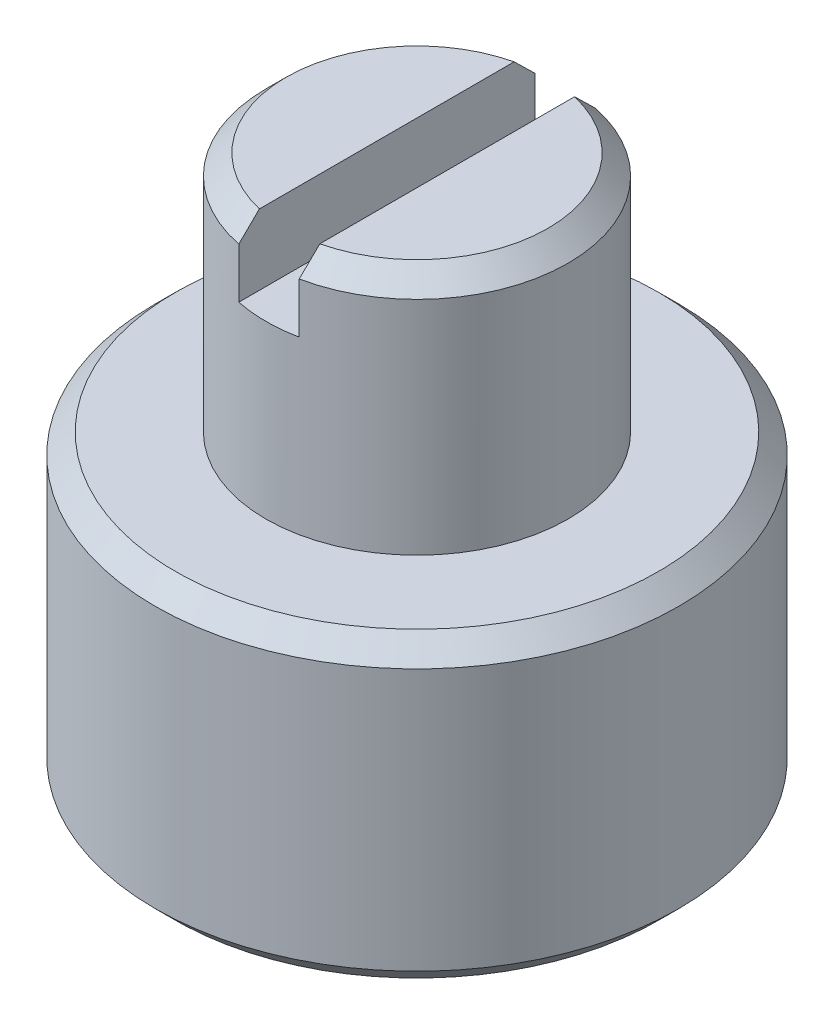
ISO-10303-21;
HEADER;
FILE_DESCRIPTION(('STEP AP214'),'2;1');
FILE_NAME('part.step','',(''),(''),'','','');
FILE_SCHEMA(('AUTOMOTIVE_DESIGN { 1 0 10303 214 1 1 1 1 }'));
ENDSEC;
DATA;
#1=APPLICATION_CONTEXT('core data for automotive mechanical design processes');
#2=APPLICATION_PROTOCOL_DEFINITION('international standard','automotive_design',2000,#1);
#3=PRODUCT_CONTEXT('',#1,'mechanical');
#4=PRODUCT('Part','Part','',(#3));
#5=PRODUCT_RELATED_PRODUCT_CATEGORY('part','',(#4));
#6=PRODUCT_DEFINITION_FORMATION('','',#4);
#7=PRODUCT_DEFINITION_CONTEXT('part definition',#1,'design');
#8=PRODUCT_DEFINITION('design','',#6,#7);
#9=PRODUCT_DEFINITION_SHAPE('','',#8);
#10=(LENGTH_UNIT() NAMED_UNIT(*) SI_UNIT(.MILLI.,.METRE.));
#11=(NAMED_UNIT(*) PLANE_ANGLE_UNIT() SI_UNIT($,.RADIAN.));
#12=(NAMED_UNIT(*) SI_UNIT($,.STERADIAN.) SOLID_ANGLE_UNIT());
#13=UNCERTAINTY_MEASURE_WITH_UNIT(LENGTH_MEASURE(1.E-05),#10,'distance_accuracy_value','');
#14=(GEOMETRIC_REPRESENTATION_CONTEXT(3) GLOBAL_UNCERTAINTY_ASSIGNED_CONTEXT((#13)) GLOBAL_UNIT_ASSIGNED_CONTEXT((#10,
#11,#12)) REPRESENTATION_CONTEXT('',''));
#15=CARTESIAN_POINT('',(0.,0.,0.));
#16=DIRECTION('',(0.,0.,1.));
#17=DIRECTION('',(1.,0.,0.));
#18=AXIS2_PLACEMENT_3D('',#15,#16,#17);
#19=CARTESIAN_POINT('',(56.,0.,1.65));
#20=DIRECTION('',(0.,1.,0.));
#21=DIRECTION('',(0.,0.,1.));
#22=AXIS2_PLACEMENT_3D('',#19,#20,#21);
#23=PLANE('',#22);
#24=DIRECTION('',(0.,0.,1.));
#25=VECTOR('',#24,1.);
#26=CARTESIAN_POINT('',(55.7,0.,-0.949999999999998));
#27=LINE('',#26,#25);
#28=CARTESIAN_POINT('',(55.7,0.,0.385088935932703));
#29=VERTEX_POINT('',#28);
#30=CARTESIAN_POINT('',(55.7,0.,2.9149110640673));
#31=VERTEX_POINT('',#30);
#32=EDGE_CURVE('E236',#29,#31,#27,.T.);
#33=ORIENTED_EDGE('',*,*,#32,.F.);
#34=CARTESIAN_POINT('',(56.,0.,1.65));
#35=DIRECTION('',(0.,1.,0.));
#36=DIRECTION('',(0.,0.,1.));
#37=AXIS2_PLACEMENT_3D('',#34,#35,#36);
#38=CIRCLE('',#37,1.29999999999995);
#39=EDGE_CURVE('E238',#29,#31,#38,.T.);
#40=ORIENTED_EDGE('',*,*,#39,.T.);
#41=EDGE_LOOP('',(#33,#40));
#42=FACE_BOUND('',#41,.T.);
#43=ADVANCED_FACE('F67',(#42),#23,.T.);
#44=DIRECTION('',(0.,0.,1.));
#45=VECTOR('',#44,1.);
#46=CARTESIAN_POINT('',(56.3,0.,-0.949999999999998));
#47=LINE('',#46,#45);
#48=CARTESIAN_POINT('',(56.3,0.,0.385088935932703));
#49=VERTEX_POINT('',#48);
#50=CARTESIAN_POINT('',(56.3,0.,2.9149110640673));
#51=VERTEX_POINT('',#50);
#52=EDGE_CURVE('E136',#49,#51,#47,.T.);
#53=ORIENTED_EDGE('',*,*,#52,.T.);
#54=CARTESIAN_POINT('',(56.,0.,1.65));
#55=DIRECTION('',(0.,1.,0.));
#56=DIRECTION('',(0.,0.,1.));
#57=AXIS2_PLACEMENT_3D('',#54,#55,#56);
#58=CIRCLE('',#57,1.29999999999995);
#59=EDGE_CURVE('E14',#51,#49,#58,.T.);
#60=ORIENTED_EDGE('',*,*,#59,.T.);
#61=EDGE_LOOP('',(#53,#60));
#62=FACE_BOUND('',#61,.T.);
#63=ADVANCED_FACE('F214',(#62),#23,.T.);
#64=CARTESIAN_POINT('',(58.6,-5.4,1.65));
#65=DIRECTION('',(0.,-1.,0.));
#66=DIRECTION('',(0.,0.,-1.));
#67=AXIS2_PLACEMENT_3D('',#64,#65,#66);
#68=PLANE('',#67);
#69=CARTESIAN_POINT('',(56.,-5.4,1.65));
#70=DIRECTION('',(0.,-1.,0.));
#71=DIRECTION('',(0.,0.,-1.));
#72=AXIS2_PLACEMENT_3D('',#69,#70,#71);
#73=CIRCLE('',#72,2.40000000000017);
#74=CARTESIAN_POINT('',(56.,-5.4,-0.750000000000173));
#75=VERTEX_POINT('',#74);
#76=EDGE_CURVE('E145',#75,#75,#73,.T.);
#77=ORIENTED_EDGE('',*,*,#76,.T.);
#78=EDGE_LOOP('',(#77));
#79=FACE_BOUND('',#78,.T.);
#80=CARTESIAN_POINT('',(56.,-5.4,1.65));
#81=DIRECTION('',(0.,-1.,0.));
#82=DIRECTION('',(0.,0.,-1.));
#83=AXIS2_PLACEMENT_3D('',#80,#81,#82);
#84=CIRCLE('',#83,1.3);
#85=CARTESIAN_POINT('',(56.,-5.4,0.349999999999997));
#86=VERTEX_POINT('',#85);
#87=EDGE_CURVE('E240',#86,#86,#84,.T.);
#88=ORIENTED_EDGE('',*,*,#87,.F.);
#89=EDGE_LOOP('',(#88));
#90=FACE_BOUND('',#89,.T.);
#91=ADVANCED_FACE('F210',(#79,#90),#68,.T.);
#92=CARTESIAN_POINT('',(56.,-1065.45754338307,1.65));
#93=DIRECTION('',(0.,-1.,0.));
#94=DIRECTION('',(0.,0.,-1.));
#95=AXIS2_PLACEMENT_3D('',#92,#93,#94);
#96=CYLINDRICAL_SURFACE('',#95,2.6);
#97=CARTESIAN_POINT('',(56.,-5.20000000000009,1.65));
#98=DIRECTION('',(0.,-1.,0.));
#99=DIRECTION('',(0.,0.,-1.));
#100=AXIS2_PLACEMENT_3D('',#97,#98,#99);
#101=CIRCLE('',#100,2.6);
#102=CARTESIAN_POINT('',(56.,-5.20000000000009,-0.949999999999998));
#103=VERTEX_POINT('',#102);
#104=EDGE_CURVE('E155',#103,#103,#101,.F.);
#105=CARTESIAN_POINT('',(56.,-2.59999999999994,1.65));
#106=DIRECTION('',(0.,1.,0.));
#107=DIRECTION('',(0.,0.,1.));
#108=AXIS2_PLACEMENT_3D('',#105,#106,#107);
#109=CIRCLE('',#108,2.6);
#110=CARTESIAN_POINT('',(56.,-2.59999999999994,-0.949999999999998));
#111=VERTEX_POINT('',#110);
#112=EDGE_CURVE('E152',#111,#111,#109,.F.);
#113=CARTESIAN_POINT('',(56.,-5.20000000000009,-0.949999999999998));
#114=CARTESIAN_POINT('',(56.,-5.17291666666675,-0.949999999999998));
#115=CARTESIAN_POINT('',(56.,-5.1458333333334,-0.949999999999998));
#116=CARTESIAN_POINT('',(56.,-5.09166666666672,-0.949999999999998));
#117=CARTESIAN_POINT('',(56.,-5.06458333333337,-0.949999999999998));
#118=CARTESIAN_POINT('',(56.,-5.01041666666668,-0.949999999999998));
#119=CARTESIAN_POINT('',(56.,-4.98333333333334,-0.949999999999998));
#120=CARTESIAN_POINT('',(56.,-4.92916666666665,-0.949999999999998));
#121=CARTESIAN_POINT('',(56.,-4.90208333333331,-0.949999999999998));
#122=CARTESIAN_POINT('',(56.,-4.84791666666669,-0.949999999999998));
#123=CARTESIAN_POINT('',(56.,-4.82083333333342,-0.949999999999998));
#124=CARTESIAN_POINT('',(56.,-4.76666666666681,-0.949999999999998));
#125=CARTESIAN_POINT('',(56.,-4.73958333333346,-0.949999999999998));
#126=CARTESIAN_POINT('',(56.,-4.68541666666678,-0.949999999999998));
#127=CARTESIAN_POINT('',(56.,-4.65833333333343,-0.949999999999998));
#128=CARTESIAN_POINT('',(56.,-4.60416666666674,-0.949999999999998));
#129=CARTESIAN_POINT('',(56.,-4.5770833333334,-0.949999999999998));
#130=CARTESIAN_POINT('',(56.,-4.52291666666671,-0.949999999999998));
#131=CARTESIAN_POINT('',(56.,-4.49583333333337,-0.949999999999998));
#132=CARTESIAN_POINT('',(56.,-4.44166666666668,-0.949999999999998));
#133=CARTESIAN_POINT('',(56.,-4.41458333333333,-0.949999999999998));
#134=CARTESIAN_POINT('',(56.,-4.36041666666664,-0.949999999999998));
#135=CARTESIAN_POINT('',(56.,-4.3333333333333,-0.949999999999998));
#136=CARTESIAN_POINT('',(56.,-4.27916666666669,-0.949999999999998));
#137=CARTESIAN_POINT('',(56.,-4.25208333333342,-0.949999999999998));
#138=CARTESIAN_POINT('',(56.,-4.1979166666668,-0.949999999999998));
#139=CARTESIAN_POINT('',(56.,-4.17083333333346,-0.949999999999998));
#140=CARTESIAN_POINT('',(56.,-4.11666666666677,-0.949999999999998));
#141=CARTESIAN_POINT('',(56.,-4.08958333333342,-0.949999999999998));
#142=CARTESIAN_POINT('',(56.,-4.03541666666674,-0.949999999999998));
#143=CARTESIAN_POINT('',(56.,-4.00833333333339,-0.949999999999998));
#144=CARTESIAN_POINT('',(56.,-3.9541666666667,-0.949999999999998));
#145=CARTESIAN_POINT('',(56.,-3.92708333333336,-0.949999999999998));
#146=CARTESIAN_POINT('',(56.,-3.87291666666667,-0.949999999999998));
#147=CARTESIAN_POINT('',(56.,-3.84583333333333,-0.949999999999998));
#148=CARTESIAN_POINT('',(56.,-3.79166666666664,-0.949999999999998));
#149=CARTESIAN_POINT('',(56.,-3.76458333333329,-0.949999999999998));
#150=CARTESIAN_POINT('',(56.,-3.7104166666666,-0.949999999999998));
#151=CARTESIAN_POINT('',(56.,-3.68333333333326,-0.949999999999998));
#152=CARTESIAN_POINT('',(56.,-3.62916666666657,-0.949999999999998));
#153=CARTESIAN_POINT('',(56.,-3.60208333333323,-0.949999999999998));
#154=CARTESIAN_POINT('',(56.,-3.54791666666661,-0.949999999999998));
#155=CARTESIAN_POINT('',(56.,-3.52083333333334,-0.949999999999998));
#156=CARTESIAN_POINT('',(56.,-3.46666666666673,-0.949999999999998));
#157=CARTESIAN_POINT('',(56.,-3.43958333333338,-0.949999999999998));
#158=CARTESIAN_POINT('',(56.,-3.3854166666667,-0.949999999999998));
#159=CARTESIAN_POINT('',(56.,-3.35833333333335,-0.949999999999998));
#160=CARTESIAN_POINT('',(56.,-3.30416666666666,-0.949999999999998));
#161=CARTESIAN_POINT('',(56.,-3.27708333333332,-0.949999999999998));
#162=CARTESIAN_POINT('',(56.,-3.22291666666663,-0.949999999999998));
#163=CARTESIAN_POINT('',(56.,-3.19583333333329,-0.949999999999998));
#164=CARTESIAN_POINT('',(56.,-3.1416666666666,-0.949999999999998));
#165=CARTESIAN_POINT('',(56.,-3.11458333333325,-0.949999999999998));
#166=CARTESIAN_POINT('',(56.,-3.06041666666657,-0.949999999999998));
#167=CARTESIAN_POINT('',(56.,-3.03333333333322,-0.949999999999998));
#168=CARTESIAN_POINT('',(56.,-2.97916666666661,-0.949999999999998));
#169=CARTESIAN_POINT('',(56.,-2.95208333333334,-0.949999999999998));
#170=CARTESIAN_POINT('',(56.,-2.89791666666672,-0.949999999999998));
#171=CARTESIAN_POINT('',(56.,-2.87083333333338,-0.949999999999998));
#172=CARTESIAN_POINT('',(56.,-2.81666666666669,-0.949999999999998));
#173=CARTESIAN_POINT('',(56.,-2.78958333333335,-0.949999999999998));
#174=CARTESIAN_POINT('',(56.,-2.73541666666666,-0.949999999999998));
#175=CARTESIAN_POINT('',(56.,-2.70833333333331,-0.949999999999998));
#176=CARTESIAN_POINT('',(56.,-2.65416666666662,-0.949999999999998));
#177=CARTESIAN_POINT('',(56.,-2.62708333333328,-0.949999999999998));
#178=CARTESIAN_POINT('',(56.,-2.59999999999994,-0.949999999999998));
#179=B_SPLINE_CURVE_WITH_KNOTS('',3,(#113,#114,#115,#116,#117,#118,#119,#120,#121,#122,#123,
#124,#125,#126,#127,#128,#129,#130,#131,#132,#133,#134,#135,#136,#137,#138,#139,#140,#141,#142,
#143,#144,#145,#146,#147,#148,#149,#150,#151,#152,#153,#154,#155,#156,#157,#158,#159,#160,#161,
#162,#163,#164,#165,#166,#167,#168,#169,#170,#171,#172,#173,#174,#175,#176,#177,#178),
.UNSPECIFIED.,.F.,.F.,(4,2,2,2,2,2,2,2,2,2,2,2,2,2,2,2,2,2,2,2,2,2,2,2,2,2,2,2,2,2,2,2,4),(0.,
0.0812500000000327,0.162500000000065,0.243750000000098,0.325000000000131,0.406249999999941,
0.487499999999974,0.568750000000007,0.650000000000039,0.731250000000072,0.812500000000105,
0.893750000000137,0.974999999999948,1.05624999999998,1.13750000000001,1.21875000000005,
1.30000000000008,1.38125000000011,1.46250000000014,1.54375000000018,1.62500000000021,
1.70625000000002,1.78750000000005,1.86875000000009,1.95000000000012,2.03125000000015,
2.11250000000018,2.19375000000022,2.27500000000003,2.35625000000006,2.43750000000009,
2.51875000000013,2.60000000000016),.UNSPECIFIED.);
#180=EDGE_CURVE('BSEAM206',#103,#111,#179,.T.);
#181=ORIENTED_EDGE('',*,*,#104,.T.);
#182=ORIENTED_EDGE('',*,*,#112,.T.);
#183=ORIENTED_EDGE('',*,*,#180,.T.);
#184=ORIENTED_EDGE('',*,*,#180,.F.);
#185=EDGE_LOOP('',(#181,#183,#182,#184));
#186=FACE_BOUND('',#185,.T.);
#187=ADVANCED_FACE('F206',(#186),#96,.T.);
#188=CARTESIAN_POINT('',(58.6,-2.4,1.65));
#189=DIRECTION('',(0.,1.,0.));
#190=DIRECTION('',(0.,0.,1.));
#191=AXIS2_PLACEMENT_3D('',#188,#189,#190);
#192=PLANE('',#191);
#193=CARTESIAN_POINT('',(56.,-2.4,1.65));
#194=DIRECTION('',(0.,1.,0.));
#195=DIRECTION('',(0.,0.,1.));
#196=AXIS2_PLACEMENT_3D('',#193,#194,#195);
#197=CIRCLE('',#196,2.40000000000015);
#198=CARTESIAN_POINT('',(56.,-2.4,-0.750000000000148));
#199=VERTEX_POINT('',#198);
#200=EDGE_CURVE('E158',#199,#199,#197,.T.);
#201=ORIENTED_EDGE('',*,*,#200,.T.);
#202=EDGE_LOOP('',(#201));
#203=FACE_BOUND('',#202,.T.);
#204=CARTESIAN_POINT('',(56.,-2.39999999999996,1.65));
#205=DIRECTION('',(0.,-1.,0.));
#206=DIRECTION('',(0.,0.,-1.));
#207=AXIS2_PLACEMENT_3D('',#204,#205,#206);
#208=CIRCLE('',#207,1.5);
#209=CARTESIAN_POINT('',(56.,-2.39999999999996,0.149999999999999));
#210=VERTEX_POINT('',#209);
#211=EDGE_CURVE('E374',#210,#210,#208,.T.);
#212=ORIENTED_EDGE('',*,*,#211,.T.);
#213=EDGE_LOOP('',(#212));
#214=FACE_BOUND('',#213,.T.);
#215=ADVANCED_FACE('F203',(#203,#214),#192,.T.);
#216=CARTESIAN_POINT('',(56.,-1065.45754338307,1.65));
#217=DIRECTION('',(0.,-1.,0.));
#218=DIRECTION('',(0.,0.,-1.));
#219=AXIS2_PLACEMENT_3D('',#216,#217,#218);
#220=CYLINDRICAL_SURFACE('',#219,1.5);
#221=DIRECTION('',(0.,-1.,0.));
#222=VECTOR('',#221,1.);
#223=CARTESIAN_POINT('',(55.7,-1065.45754338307,3.11969384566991));
#224=LINE('',#223,#222);
#225=CARTESIAN_POINT('',(55.7,-0.199999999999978,3.11969384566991));
#226=VERTEX_POINT('',#225);
#227=CARTESIAN_POINT('',(55.7,-0.699999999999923,3.11969384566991));
#228=VERTEX_POINT('',#227);
#229=EDGE_CURVE('E143',#226,#228,#224,.T.);
#230=ORIENTED_EDGE('',*,*,#229,.F.);
#231=CARTESIAN_POINT('',(56.,-0.199999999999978,1.65));
#232=DIRECTION('',(0.,1.,0.));
#233=DIRECTION('',(0.,0.,1.));
#234=AXIS2_PLACEMENT_3D('',#231,#232,#233);
#235=CIRCLE('',#234,1.5);
#236=CARTESIAN_POINT('',(55.7,-0.199999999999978,0.180306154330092));
#237=VERTEX_POINT('',#236);
#238=EDGE_CURVE('E162',#226,#237,#235,.F.);
#239=ORIENTED_EDGE('',*,*,#238,.T.);
#240=DIRECTION('',(0.,-1.,0.));
#241=VECTOR('',#240,1.);
#242=CARTESIAN_POINT('',(55.7,-1065.45754338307,0.180306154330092));
#243=LINE('',#242,#241);
#244=CARTESIAN_POINT('',(55.7,-0.699999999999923,0.180306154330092));
#245=VERTEX_POINT('',#244);
#246=EDGE_CURVE('E130',#245,#237,#243,.F.);
#247=ORIENTED_EDGE('',*,*,#246,.F.);
#248=CARTESIAN_POINT('',(56.,-0.699999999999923,1.65));
#249=DIRECTION('',(0.,-1.,0.));
#250=DIRECTION('',(0.,0.,-1.));
#251=AXIS2_PLACEMENT_3D('',#248,#249,#250);
#252=CIRCLE('',#251,1.5);
#253=CARTESIAN_POINT('',(56.3,-0.699999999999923,0.180306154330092));
#254=VERTEX_POINT('',#253);
#255=EDGE_CURVE('E132',#254,#245,#252,.F.);
#256=ORIENTED_EDGE('',*,*,#255,.F.);
#257=DIRECTION('',(0.,-1.,0.));
#258=VECTOR('',#257,1.);
#259=CARTESIAN_POINT('',(56.3,-1065.45754338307,0.180306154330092));
#260=LINE('',#259,#258);
#261=CARTESIAN_POINT('',(56.3,-0.199999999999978,0.180306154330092));
#262=VERTEX_POINT('',#261);
#263=EDGE_CURVE('E135',#262,#254,#260,.T.);
#264=ORIENTED_EDGE('',*,*,#263,.F.);
#265=CARTESIAN_POINT('',(56.,-0.199999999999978,1.65));
#266=DIRECTION('',(0.,1.,0.));
#267=DIRECTION('',(0.,0.,1.));
#268=AXIS2_PLACEMENT_3D('',#265,#266,#267);
#269=CIRCLE('',#268,1.5);
#270=CARTESIAN_POINT('',(56.3,-0.199999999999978,3.11969384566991));
#271=VERTEX_POINT('',#270);
#272=EDGE_CURVE('E142',#262,#271,#269,.F.);
#273=ORIENTED_EDGE('',*,*,#272,.T.);
#274=DIRECTION('',(0.,-1.,0.));
#275=VECTOR('',#274,1.);
#276=CARTESIAN_POINT('',(56.3,-1065.45754338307,3.11969384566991));
#277=LINE('',#276,#275);
#278=CARTESIAN_POINT('',(56.3,-0.699999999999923,3.11969384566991));
#279=VERTEX_POINT('',#278);
#280=EDGE_CURVE('E129',#279,#271,#277,.F.);
#281=ORIENTED_EDGE('',*,*,#280,.F.);
#282=EDGE_CURVE('E119',#228,#279,#252,.F.);
#283=ORIENTED_EDGE('',*,*,#282,.F.);
#284=EDGE_LOOP('',(#230,#239,#247,#256,#264,#273,#281,#283));
#285=FACE_BOUND('',#284,.T.);
#286=ORIENTED_EDGE('',*,*,#211,.F.);
#287=EDGE_LOOP('',(#286));
#288=FACE_BOUND('',#287,.T.);
#289=ADVANCED_FACE('F139',(#285,#288),#220,.T.);
#290=CARTESIAN_POINT('',(56.,-2.5,1.65));
#291=DIRECTION('',(0.,1.,0.));
#292=DIRECTION('',(0.,0.,1.));
#293=AXIS2_PLACEMENT_3D('',#290,#291,#292);
#294=PLANE('',#293);
#295=CARTESIAN_POINT('',(56.,-2.5,1.65));
#296=DIRECTION('',(0.,-1.,0.));
#297=DIRECTION('',(0.,0.,-1.));
#298=AXIS2_PLACEMENT_3D('',#295,#296,#297);
#299=CIRCLE('',#298,1.025);
#300=CARTESIAN_POINT('',(56.,-2.5,0.625000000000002));
#301=VERTEX_POINT('',#300);
#302=EDGE_CURVE('E378',#301,#301,#299,.T.);
#303=ORIENTED_EDGE('',*,*,#302,.T.);
#304=EDGE_LOOP('',(#303));
#305=FACE_BOUND('',#304,.T.);
#306=ADVANCED_FACE('F196',(#305),#294,.F.);
#307=CARTESIAN_POINT('',(56.,-5.4,1.65));
#308=DIRECTION('',(0.,-1.,0.));
#309=DIRECTION('',(0.,0.,-1.));
#310=AXIS2_PLACEMENT_3D('',#307,#308,#309);
#311=CYLINDRICAL_SURFACE('',#310,1.025);
#312=ORIENTED_EDGE('',*,*,#302,.F.);
#313=EDGE_LOOP('',(#312));
#314=FACE_BOUND('',#313,.T.);
#315=CARTESIAN_POINT('',(56.,-5.125,1.65));
#316=DIRECTION('',(0.,-1.,0.));
#317=DIRECTION('',(0.,0.,-1.));
#318=AXIS2_PLACEMENT_3D('',#315,#316,#317);
#319=CIRCLE('',#318,1.025);
#320=CARTESIAN_POINT('',(56.,-5.125,0.625000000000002));
#321=VERTEX_POINT('',#320);
#322=EDGE_CURVE('E381',#321,#321,#319,.T.);
#323=ORIENTED_EDGE('',*,*,#322,.T.);
#324=EDGE_LOOP('',(#323));
#325=FACE_BOUND('',#324,.T.);
#326=ADVANCED_FACE('F192',(#314,#325),#311,.F.);
#327=CARTESIAN_POINT('',(56.,-5.4,1.65));
#328=DIRECTION('',(0.,-1.,0.));
#329=DIRECTION('',(0.,0.,-1.));
#330=AXIS2_PLACEMENT_3D('',#327,#328,#329);
#331=CONICAL_SURFACE('',#330,1.3,0.785398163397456);
#332=ORIENTED_EDGE('',*,*,#322,.F.);
#333=EDGE_LOOP('',(#332));
#334=FACE_BOUND('',#333,.T.);
#335=ORIENTED_EDGE('',*,*,#87,.T.);
#336=EDGE_LOOP('',(#335));
#337=FACE_BOUND('',#336,.T.);
#338=ADVANCED_FACE('F186',(#334,#337),#331,.F.);
#339=CARTESIAN_POINT('',(55.7,0.,-0.949999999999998));
#340=DIRECTION('',(-1.,0.,0.));
#341=DIRECTION('',(0.,0.,1.));
#342=AXIS2_PLACEMENT_3D('',#339,#340,#341);
#343=PLANE('',#342);
#344=ORIENTED_EDGE('',*,*,#246,.T.);
#345=CARTESIAN_POINT('',(55.7,-0.199999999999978,0.180306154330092));
#346=CARTESIAN_POINT('',(55.7,-0.166607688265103,0.214379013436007));
#347=CARTESIAN_POINT('',(55.7,-0.133244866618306,0.248480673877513));
#348=CARTESIAN_POINT('',(55.7,-0.0665781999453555,0.316741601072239));
#349=CARTESIAN_POINT('',(55.7,-0.0332743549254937,0.350900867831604));
#350=CARTESIAN_POINT('',(55.7,0.,0.385088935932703));
#351=B_SPLINE_CURVE_WITH_KNOTS('',3,(#345,#346,#347,#348,#349,#350),.UNSPECIFIED.,.F.,.F.,(4,2,
4),(0.,0.143122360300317,0.286244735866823),.UNSPECIFIED.);
#352=EDGE_CURVE('E172',#237,#29,#351,.T.);
#353=ORIENTED_EDGE('',*,*,#352,.T.);
#354=ORIENTED_EDGE('',*,*,#32,.T.);
#355=CARTESIAN_POINT('',(55.7,0.,2.9149110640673));
#356=CARTESIAN_POINT('',(55.7,-0.0332743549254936,2.9490991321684));
#357=CARTESIAN_POINT('',(55.7,-0.0665781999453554,2.98325839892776));
#358=CARTESIAN_POINT('',(55.7,-0.133244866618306,3.05151932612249));
#359=CARTESIAN_POINT('',(55.7,-0.166607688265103,3.08562098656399));
#360=CARTESIAN_POINT('',(55.7,-0.199999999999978,3.11969384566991));
#361=B_SPLINE_CURVE_WITH_KNOTS('',3,(#355,#356,#357,#358,#359,#360),.UNSPECIFIED.,.F.,.F.,(4,2,
4),(0.,0.143122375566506,0.286244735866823),.UNSPECIFIED.);
#362=EDGE_CURVE('E165',#31,#226,#361,.T.);
#363=ORIENTED_EDGE('',*,*,#362,.T.);
#364=ORIENTED_EDGE('',*,*,#229,.T.);
#365=DIRECTION('',(0.,0.,1.));
#366=VECTOR('',#365,1.);
#367=CARTESIAN_POINT('',(55.7,-0.7,-0.949999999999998));
#368=LINE('',#367,#366);
#369=EDGE_CURVE('E125',#245,#228,#368,.T.);
#370=ORIENTED_EDGE('',*,*,#369,.F.);
#371=EDGE_LOOP('',(#344,#353,#354,#363,#364,#370));
#372=FACE_BOUND('',#371,.T.);
#373=ADVANCED_FACE('F181',(#372),#343,.F.);
#374=CARTESIAN_POINT('',(56.3,0.,-0.949999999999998));
#375=DIRECTION('',(1.,0.,0.));
#376=DIRECTION('',(0.,0.,-1.));
#377=AXIS2_PLACEMENT_3D('',#374,#375,#376);
#378=PLANE('',#377);
#379=ORIENTED_EDGE('',*,*,#280,.T.);
#380=CARTESIAN_POINT('',(56.3,-0.199999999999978,3.11969384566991));
#381=CARTESIAN_POINT('',(56.3,-0.166607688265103,3.08562098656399));
#382=CARTESIAN_POINT('',(56.3,-0.133244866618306,3.05151932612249));
#383=CARTESIAN_POINT('',(56.3,-0.0665781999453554,2.98325839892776));
#384=CARTESIAN_POINT('',(56.3,-0.0332743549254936,2.9490991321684));
#385=CARTESIAN_POINT('',(56.3,0.,2.9149110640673));
#386=B_SPLINE_CURVE_WITH_KNOTS('',3,(#380,#381,#382,#383,#384,#385),.UNSPECIFIED.,.F.,.F.,(4,2,
4),(0.,0.143122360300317,0.286244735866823),.UNSPECIFIED.);
#387=EDGE_CURVE('E76',#271,#51,#386,.T.);
#388=ORIENTED_EDGE('',*,*,#387,.T.);
#389=ORIENTED_EDGE('',*,*,#52,.F.);
#390=CARTESIAN_POINT('',(56.3,0.,0.385088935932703));
#391=CARTESIAN_POINT('',(56.3,-0.0332743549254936,0.350900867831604));
#392=CARTESIAN_POINT('',(56.3,-0.0665781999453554,0.316741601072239));
#393=CARTESIAN_POINT('',(56.3,-0.133244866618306,0.248480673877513));
#394=CARTESIAN_POINT('',(56.3,-0.166607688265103,0.214379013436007));
#395=CARTESIAN_POINT('',(56.3,-0.199999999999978,0.180306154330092));
#396=B_SPLINE_CURVE_WITH_KNOTS('',3,(#390,#391,#392,#393,#394,#395),.UNSPECIFIED.,.F.,.F.,(4,2,
4),(0.,0.143122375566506,0.286244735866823),.UNSPECIFIED.);
#397=EDGE_CURVE('E243',#49,#262,#396,.T.);
#398=ORIENTED_EDGE('',*,*,#397,.T.);
#399=ORIENTED_EDGE('',*,*,#263,.T.);
#400=DIRECTION('',(0.,0.,1.));
#401=VECTOR('',#400,1.);
#402=CARTESIAN_POINT('',(56.3,-0.7,-0.949999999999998));
#403=LINE('',#402,#401);
#404=EDGE_CURVE('E122',#254,#279,#403,.T.);
#405=ORIENTED_EDGE('',*,*,#404,.T.);
#406=EDGE_LOOP('',(#379,#388,#389,#398,#399,#405));
#407=FACE_BOUND('',#406,.T.);
#408=ADVANCED_FACE('F133',(#407),#378,.F.);
#409=CARTESIAN_POINT('',(55.7,-0.7,-0.949999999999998));
#410=DIRECTION('',(0.,-1.,0.));
#411=DIRECTION('',(0.,0.,-1.));
#412=AXIS2_PLACEMENT_3D('',#409,#410,#411);
#413=PLANE('',#412);
#414=ORIENTED_EDGE('',*,*,#282,.T.);
#415=ORIENTED_EDGE('',*,*,#404,.F.);
#416=ORIENTED_EDGE('',*,*,#255,.T.);
#417=ORIENTED_EDGE('',*,*,#369,.T.);
#418=EDGE_LOOP('',(#414,#415,#416,#417));
#419=FACE_BOUND('',#418,.T.);
#420=ADVANCED_FACE('F121',(#419),#413,.F.);
#421=CARTESIAN_POINT('',(56.,-5.40000000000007,1.65));
#422=DIRECTION('',(0.,1.,0.));
#423=DIRECTION('',(0.,0.,1.));
#424=AXIS2_PLACEMENT_3D('',#421,#422,#423);
#425=CONICAL_SURFACE('',#424,2.4000000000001,0.785398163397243);
#426=ORIENTED_EDGE('',*,*,#104,.F.);
#427=EDGE_LOOP('',(#426));
#428=FACE_BOUND('',#427,.T.);
#429=ORIENTED_EDGE('',*,*,#76,.F.);
#430=EDGE_LOOP('',(#429));
#431=FACE_BOUND('',#430,.T.);
#432=ADVANCED_FACE('F218',(#428,#431),#425,.T.);
#433=CARTESIAN_POINT('',(56.,-2.59999999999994,1.65));
#434=DIRECTION('',(0.,-1.,0.));
#435=DIRECTION('',(0.,0.,-1.));
#436=AXIS2_PLACEMENT_3D('',#433,#434,#435);
#437=CONICAL_SURFACE('',#436,2.6,0.785398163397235);
#438=CARTESIAN_POINT('',(56.,-2.4,-0.750000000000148));
#439=CARTESIAN_POINT('',(56.,-2.40208333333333,-0.75208333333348));
#440=CARTESIAN_POINT('',(56.,-2.40416666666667,-0.754166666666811));
#441=CARTESIAN_POINT('',(56.,-2.40833333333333,-0.758333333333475));
#442=CARTESIAN_POINT('',(56.,-2.41041666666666,-0.760416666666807));
#443=CARTESIAN_POINT('',(56.,-2.41458333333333,-0.76458333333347));
#444=CARTESIAN_POINT('',(56.,-2.41666666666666,-0.766666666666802));
#445=CARTESIAN_POINT('',(56.,-2.42083333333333,-0.770833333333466));
#446=CARTESIAN_POINT('',(56.,-2.42291666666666,-0.772916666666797));
#447=CARTESIAN_POINT('',(56.,-2.42708333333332,-0.777083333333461));
#448=CARTESIAN_POINT('',(56.,-2.42916666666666,-0.779166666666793));
#449=CARTESIAN_POINT('',(56.,-2.43333333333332,-0.783333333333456));
#450=CARTESIAN_POINT('',(56.,-2.43541666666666,-0.785416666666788));
#451=CARTESIAN_POINT('',(56.,-2.43958333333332,-0.789583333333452));
#452=CARTESIAN_POINT('',(56.,-2.44166666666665,-0.791666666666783));
#453=CARTESIAN_POINT('',(56.,-2.44583333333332,-0.795833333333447));
#454=CARTESIAN_POINT('',(56.,-2.44791666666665,-0.797916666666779));
#455=CARTESIAN_POINT('',(56.,-2.45208333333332,-0.802083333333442));
#456=CARTESIAN_POINT('',(56.,-2.45416666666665,-0.804166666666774));
#457=CARTESIAN_POINT('',(56.,-2.45833333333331,-0.808333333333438));
#458=CARTESIAN_POINT('',(56.,-2.46041666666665,-0.810416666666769));
#459=CARTESIAN_POINT('',(56.,-2.46458333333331,-0.814583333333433));
#460=CARTESIAN_POINT('',(56.,-2.46666666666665,-0.816666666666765));
#461=CARTESIAN_POINT('',(56.,-2.47083333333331,-0.820833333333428));
#462=CARTESIAN_POINT('',(56.,-2.47291666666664,-0.82291666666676));
#463=CARTESIAN_POINT('',(56.,-2.47708333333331,-0.827083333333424));
#464=CARTESIAN_POINT('',(56.,-2.47916666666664,-0.829166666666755));
#465=CARTESIAN_POINT('',(56.,-2.48333333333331,-0.833333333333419));
#466=CARTESIAN_POINT('',(56.,-2.48541666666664,-0.835416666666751));
#467=CARTESIAN_POINT('',(56.,-2.4895833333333,-0.839583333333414));
#468=CARTESIAN_POINT('',(56.,-2.49166666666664,-0.841666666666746));
#469=CARTESIAN_POINT('',(56.,-2.4958333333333,-0.84583333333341));
#470=CARTESIAN_POINT('',(56.,-2.49791666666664,-0.847916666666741));
#471=CARTESIAN_POINT('',(56.,-2.5020833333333,-0.852083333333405));
#472=CARTESIAN_POINT('',(56.,-2.50416666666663,-0.854166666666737));
#473=CARTESIAN_POINT('',(56.,-2.5083333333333,-0.8583333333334));
#474=CARTESIAN_POINT('',(56.,-2.51041666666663,-0.860416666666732));
#475=CARTESIAN_POINT('',(56.,-2.5145833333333,-0.864583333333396));
#476=CARTESIAN_POINT('',(56.,-2.51666666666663,-0.866666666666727));
#477=CARTESIAN_POINT('',(56.,-2.52083333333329,-0.870833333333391));
#478=CARTESIAN_POINT('',(56.,-2.52291666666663,-0.872916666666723));
#479=CARTESIAN_POINT('',(56.,-2.52708333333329,-0.877083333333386));
#480=CARTESIAN_POINT('',(56.,-2.52916666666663,-0.879166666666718));
#481=CARTESIAN_POINT('',(56.,-2.53333333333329,-0.883333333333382));
#482=CARTESIAN_POINT('',(56.,-2.53541666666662,-0.885416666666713));
#483=CARTESIAN_POINT('',(56.,-2.53958333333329,-0.889583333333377));
#484=CARTESIAN_POINT('',(56.,-2.54166666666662,-0.891666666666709));
#485=CARTESIAN_POINT('',(56.,-2.54583333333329,-0.895833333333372));
#486=CARTESIAN_POINT('',(56.,-2.54791666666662,-0.897916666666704));
#487=CARTESIAN_POINT('',(56.,-2.55208333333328,-0.902083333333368));
#488=CARTESIAN_POINT('',(56.,-2.55416666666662,-0.904166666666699));
#489=CARTESIAN_POINT('',(56.,-2.55833333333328,-0.908333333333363));
#490=CARTESIAN_POINT('',(56.,-2.56041666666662,-0.910416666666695));
#491=CARTESIAN_POINT('',(56.,-2.56458333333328,-0.914583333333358));
#492=CARTESIAN_POINT('',(56.,-2.56666666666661,-0.91666666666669));
#493=CARTESIAN_POINT('',(56.,-2.57083333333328,-0.920833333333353));
#494=CARTESIAN_POINT('',(56.,-2.57291666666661,-0.922916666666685));
#495=CARTESIAN_POINT('',(56.,-2.57708333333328,-0.927083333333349));
#496=CARTESIAN_POINT('',(56.,-2.57916666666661,-0.929166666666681));
#497=CARTESIAN_POINT('',(56.,-2.58333333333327,-0.933333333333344));
#498=CARTESIAN_POINT('',(56.,-2.58541666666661,-0.935416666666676));
#499=CARTESIAN_POINT('',(56.,-2.58958333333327,-0.93958333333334));
#500=CARTESIAN_POINT('',(56.,-2.59166666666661,-0.941666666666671));
#501=CARTESIAN_POINT('',(56.,-2.59583333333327,-0.945833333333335));
#502=CARTESIAN_POINT('',(56.,-2.5979166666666,-0.947916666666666));
#503=CARTESIAN_POINT('',(56.,-2.59999999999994,-0.949999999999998));
#504=B_SPLINE_CURVE_WITH_KNOTS('',3,(#438,#439,#440,#441,#442,#443,#444,#445,#446,#447,#448,
#449,#450,#451,#452,#453,#454,#455,#456,#457,#458,#459,#460,#461,#462,#463,#464,#465,#466,#467,
#468,#469,#470,#471,#472,#473,#474,#475,#476,#477,#478,#479,#480,#481,#482,#483,#484,#485,#486,
#487,#488,#489,#490,#491,#492,#493,#494,#495,#496,#497,#498,#499,#500,#501,#502,#503),
.UNSPECIFIED.,.F.,.F.,(4,2,2,2,2,2,2,2,2,2,2,2,2,2,2,2,2,2,2,2,2,2,2,2,2,2,2,2,2,2,2,2,4),(0.,
0.00883883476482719,0.0176776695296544,0.0265165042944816,0.0353553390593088,0.0441941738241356,
0.0530330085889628,0.06187184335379,0.0707106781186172,0.0795495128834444,0.0883883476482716,
0.0972271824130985,0.106066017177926,0.114904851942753,0.12374368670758,0.132582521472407,
0.141421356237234,0.150260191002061,0.159099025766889,0.167937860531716,0.176776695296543,
0.18561553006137,0.194454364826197,0.203293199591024,0.212132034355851,0.220970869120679,
0.229809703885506,0.238648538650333,0.24748737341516,0.256326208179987,0.265165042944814,
0.274003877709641,0.282842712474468),.UNSPECIFIED.);
#505=EDGE_CURVE('BSEAM220',#199,#111,#504,.T.);
#506=ORIENTED_EDGE('',*,*,#200,.F.);
#507=ORIENTED_EDGE('',*,*,#112,.F.);
#508=ORIENTED_EDGE('',*,*,#505,.T.);
#509=ORIENTED_EDGE('',*,*,#505,.F.);
#510=EDGE_LOOP('',(#506,#508,#507,#509));
#511=FACE_BOUND('',#510,.T.);
#512=ADVANCED_FACE('F220',(#511),#437,.T.);
#513=CARTESIAN_POINT('',(56.,-0.199999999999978,1.65));
#514=DIRECTION('',(0.,-1.,0.));
#515=DIRECTION('',(0.,0.,-1.));
#516=AXIS2_PLACEMENT_3D('',#513,#514,#515);
#517=CONICAL_SURFACE('',#516,1.5,0.785398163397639);
#518=ORIENTED_EDGE('',*,*,#362,.F.);
#519=ORIENTED_EDGE('',*,*,#39,.F.);
#520=ORIENTED_EDGE('',*,*,#352,.F.);
#521=ORIENTED_EDGE('',*,*,#238,.F.);
#522=EDGE_LOOP('',(#518,#519,#520,#521));
#523=FACE_BOUND('',#522,.T.);
#524=ADVANCED_FACE('F178',(#523),#517,.T.);
#525=CARTESIAN_POINT('',(56.,-0.199999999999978,1.65));
#526=DIRECTION('',(0.,-1.,0.));
#527=DIRECTION('',(0.,0.,-1.));
#528=AXIS2_PLACEMENT_3D('',#525,#526,#527);
#529=CONICAL_SURFACE('',#528,1.5,0.785398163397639);
#530=ORIENTED_EDGE('',*,*,#397,.F.);
#531=ORIENTED_EDGE('',*,*,#59,.F.);
#532=ORIENTED_EDGE('',*,*,#387,.F.);
#533=ORIENTED_EDGE('',*,*,#272,.F.);
#534=EDGE_LOOP('',(#530,#531,#532,#533));
#535=FACE_BOUND('',#534,.T.);
#536=ADVANCED_FACE('F69',(#535),#529,.T.);
#537=CLOSED_SHELL('',(#43,#63,#91,#187,#215,#289,#306,#326,#338,#373,#408,#420,#432,#512,#524,#536));
#538=MANIFOLD_SOLID_BREP('B2',#537);
#539=ADVANCED_BREP_SHAPE_REPRESENTATION('',(#18,#538),#14);
#540=SHAPE_DEFINITION_REPRESENTATION(#9,#539);
ENDSEC;
END-ISO-10303-21;
